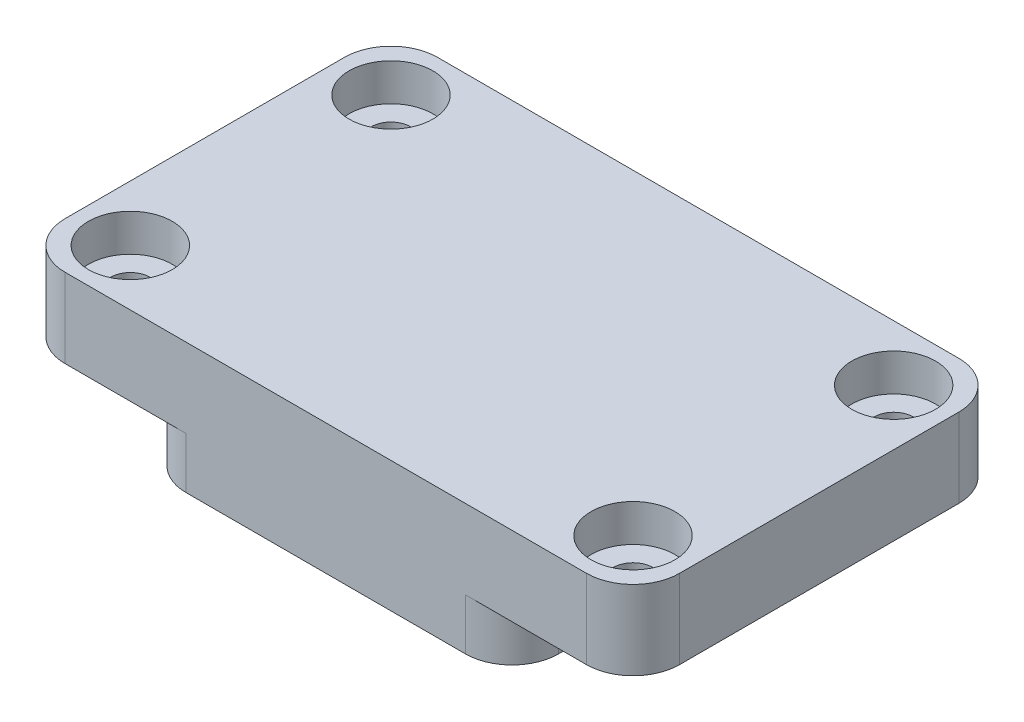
from build123d import *

# Parameters (mm, degrees)
BOSS_EXTRUDE1_DEPTH                      = 7
M1_6_TAPPED_HOLE1_D                      = 1.25
M1_6_TAPPED_HOLE1_DEPTH                  = 5.25
M1_6_TAPPED_HOLE1_TIP                    = 0.375537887
SKETCH9_W                                = 6.6
SKETCH9_H                                = 1.85
CUT_EXTRUDE3_DEPTH                       = 4.25
BOSS_EXTRUDE2_START                      = -4.25
BOSS_EXTRUDE2_DEPTH                      = 4.25
CBORE_FOR_M2_PAN_HEAD_SCREW1_D           = 2.1
CBORE_FOR_M2_PAN_HEAD_SCREW1_CBORE_D     = 4.5
CBORE_FOR_M2_PAN_HEAD_SCREW1_CBORE_DEPTH = 2


with BuildPart() as part:
    # Sketch1 → Boss-Extrude1 (new body)
    with BuildSketch(Plane(origin=(0, 0, 0), x_dir=(1, 0, 0), z_dir=(0, 1, 0))):
        with BuildLine():
            Line((-7.5, -10), (7.5, -10))
            ThreePointArc((7.5, -10), (9.267766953, -9.267766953), (10, -7.5))
            Line((10, -7.5), (10, 7.5))
            ThreePointArc((10, 7.5), (9.267766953, 9.267766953), (7.5, 10))
            Line((7.5, 10), (-7.5, 10))
            ThreePointArc((-7.5, 10), (-9.267766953, 9.267766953), (-10, 7.5))
            Line((-10, 7.5), (-10, -7.5))
            ThreePointArc((-10, -7.5), (-9.267766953, -9.267766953), (-7.5, -10))
        make_face()
    extrude(amount=BOSS_EXTRUDE1_DEPTH)

    # M1.6 Tapped Hole1
    with Locations(Plane(origin=(0, 0, 0), x_dir=(-1, 0, 0), z_dir=(0, -1, 0))):
        with Locations((-5.5, -5.5), (5.5, 5.5)):
            Hole(M1_6_TAPPED_HOLE1_D / 2, depth=M1_6_TAPPED_HOLE1_DEPTH)
            with Locations((0, 0, -(M1_6_TAPPED_HOLE1_DEPTH + M1_6_TAPPED_HOLE1_TIP / 2))):  # 118° drill point
                Cone(0, M1_6_TAPPED_HOLE1_D / 2, M1_6_TAPPED_HOLE1_TIP, mode=Mode.SUBTRACT)

    # Sketch9 → Cut-Extrude3 (cut)
    with BuildSketch(Plane(origin=(10, 0, 0), x_dir=(0, 0, -1), z_dir=(1, 0, 0))):
        with Locations((0.6, 0.925)):
            Rectangle(SKETCH9_W, SKETCH9_H)
    extrude(amount=-CUT_EXTRUDE3_DEPTH, mode=Mode.SUBTRACT)

    # Sketch14 → Boss-Extrude2 (add)
    with BuildSketch(Plane(origin=(0, 7, 0), x_dir=(1, 0, 0), z_dir=(0, 1, 0)).offset(BOSS_EXTRUDE2_START)):
        with BuildLine():
            Line((7.5, 10), (14, 10))
            ThreePointArc((14, 10), (15.767766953, 9.267766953), (16.5, 7.5))
            Line((16.5, 7.5), (16.5, -7.5))
            ThreePointArc((16.5, -7.5), (15.767766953, -9.267766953), (14, -10))
            Line((14, -10), (7.5, -10))
            ThreePointArc((7.5, -10), (9.267766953, -9.267766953), (10, -7.5))
            Line((10, -7.5), (10, 7.5))
            ThreePointArc((10, 7.5), (9.267766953, 9.267766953), (7.5, 10))
        make_face()
        with BuildLine():
            Line((-16.5, 7.5), (-16.5, -7.5))
            ThreePointArc((-16.5, -7.5), (-15.767766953, -9.267766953), (-14, -10))
            Line((-14, -10), (-7.5, -10))
            ThreePointArc((-7.5, -10), (-9.267766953, -9.267766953), (-10, -7.5))
            Line((-10, -7.5), (-10, 7.5))
            ThreePointArc((-10, 7.5), (-9.267766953, 9.267766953), (-7.5, 10))
            Line((-7.5, 10), (-14, 10))
            ThreePointArc((-14, 10), (-15.767766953, 9.267766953), (-16.5, 7.5))
        make_face()
    extrude(amount=BOSS_EXTRUDE2_DEPTH)

    # CBORE for M2 Pan Head Screw1 (through all)
    with Locations(Plane(origin=(0, 7, 0), x_dir=(1, 0, 0), z_dir=(0, 1, 0))):
        with Locations((13.5, -7), (-13.5, -7), (-13.5, 7), (13.5, 7)):
            CounterBoreHole(CBORE_FOR_M2_PAN_HEAD_SCREW1_D / 2, CBORE_FOR_M2_PAN_HEAD_SCREW1_CBORE_D / 2, CBORE_FOR_M2_PAN_HEAD_SCREW1_CBORE_DEPTH)


solid = part.part
